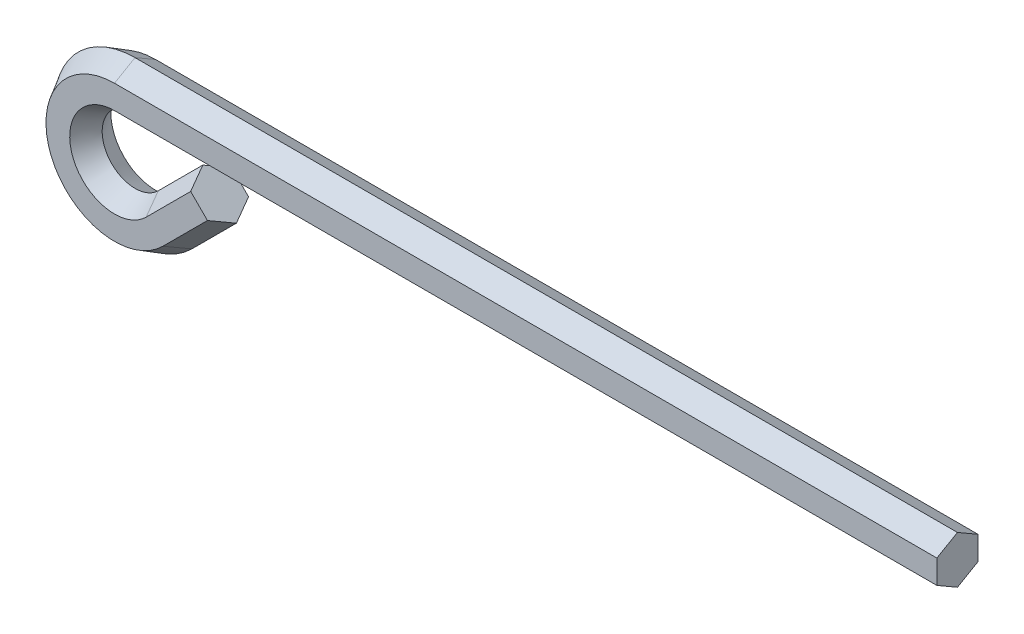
from build123d import *


with BuildPart() as part:
    # Base-Sweep: sweep along a path in Sketch1
    with BuildLine(Plane.XY) as base_sweep_path:
        Line((100, 4), (0, 4))
        ThreePointArc((0, 4), (-3.69551813, -1.530733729), (2.828427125, -2.828427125))
        Line((2.828427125, -2.828427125), (8.242640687, 2.585786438))
    # Sketch2 → Base-Sweep (sweep)
    with BuildSketch(Plane(origin=(100, 4, 0), x_dir=(0, 0, 1), z_dir=(-1, 0, 0))):
        Polygon((-2.5, 4.330127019), (0, 5.773502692), (2.5, 4.330127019), (2.5, 1.443375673), (0, 0), (-2.5, 1.443375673), align=None)
    sweep(path=base_sweep_path.line)


solid = part.part
